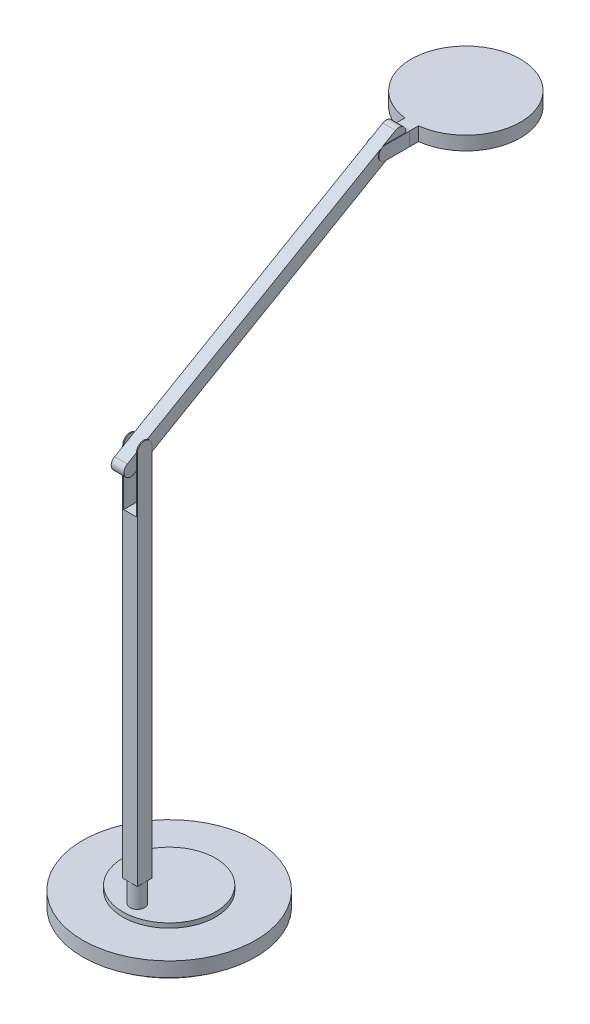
from build123d import *

# Parameters (mm, degrees)
CROQUIS1_R                          = 87
CROQUIS2_R                          = 95
CROQUIS3_R                          = 95
SALIENTE_EXTRUIR1_DEPTH             = 16
CROQUIS4_R                          = 51
SALIENTE_EXTRUIR2_DEPTH             = 5
CROQUIS5_R                          = 8
CROQUIS5_R_2                        = 6
SALIENTE_EXTRUIR3_DEPTH             = 24
SALIENTE_EXTRUIR4_DEPTH             = 420
CROQUIS7_W                          = 14
CROQUIS7_H                          = 16
CORTAR_EXTRUIR1_DEPTH               = 69
CORTAR_EXTRUIR2_DEPTH               = 492.40105824
SALIENTE_EXTRUIR5_REACH             = 491.787
SALIENTE_EXTRUIR5_DIRECTION_2_REACH = 491.787
SALIENTE_EXTRUIR6_DEPTH             = 7.5
SALIENTE_EXTRUIR6_DEPTH_BACK        = 7.5
SALIENTE_EXTRUIR7_DEPTH             = 15
CROQUIS14_R                         = 48
CORTAR_EXTRUIR3_DEPTH               = 2


with BuildPart() as part:
    # Croquis1 → Recubrir1 section 0
    with BuildSketch(Plane(origin=(0, 0, 0), x_dir=(1, 0, 0), z_dir=(0, 1, 0))):
        Circle(CROQUIS1_R)
    # Croquis2 → Recubrir1 section 1
    with BuildSketch(Plane(origin=(0, 6, 0), x_dir=(1, 0, 0), z_dir=(0, 1, 0))):
        Circle(CROQUIS2_R)
    loft()

    # Croquis3 → Saliente-Extruir1 (add)
    with BuildSketch(Plane(origin=(0, 6, 0), x_dir=(1, 0, 0), z_dir=(0, 1, 0))):
        with Locations(Location((0, 0, 0), (0, 0, 270))):
            Circle(CROQUIS3_R)
    extrude(amount=SALIENTE_EXTRUIR1_DEPTH)

    # Croquis4 → Saliente-Extruir2 (add)
    with BuildSketch(Plane(origin=(0, 22, 0), x_dir=(1, 0, 0), z_dir=(0, 1, 0))):
        with Locations(Location((0, 0, 0), (0, 0, 270))):
            Circle(CROQUIS4_R)
    extrude(amount=SALIENTE_EXTRUIR2_DEPTH)

    # Croquis5 → Saliente-Extruir3 (add)
    with BuildSketch(Plane(origin=(0, 27, 0), x_dir=(1, 0, 0), z_dir=(0, 1, 0))):
        with Locations(Location((0, -35, 0), (0, 0, 270))):
            Circle(CROQUIS5_R)
        with Locations(Location((0, -35, 0), (0, 0, 270))):
            Circle(CROQUIS5_R_2, mode=Mode.SUBTRACT)
    extrude(amount=SALIENTE_EXTRUIR3_DEPTH)

    # Croquis6 → Saliente-Extruir4 (add)
    with BuildSketch(Plane(origin=(0, 51, 0), x_dir=(1, 0, 0), z_dir=(0, 1, 0))):
        Polygon((0, -27), (8, -27), (8, -43), (-8, -43), (-8, -27), align=None)
    extrude(amount=SALIENTE_EXTRUIR4_DEPTH)

    # Croquis7 → Cortar-Extruir1 (cut)
    with BuildSketch(Plane(origin=(0, 471, 0), x_dir=(1, 0, 0), z_dir=(0, 1, 0))):
        with Locations((0, -35)):
            Rectangle(CROQUIS7_W, CROQUIS7_H)
    extrude(amount=-CORTAR_EXTRUIR1_DEPTH, mode=Mode.SUBTRACT)

    # Croquis8 → Cortar-Extruir2 (cut, through all)
    with BuildSketch(Plane.ZY.offset(8)):
        with BuildLine():
            Line((27, 471), (27, 463))
            ThreePointArc((27, 463), (29.343145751, 468.656854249), (35, 471))
            Line((35, 471), (27, 471))
        make_face()
        with BuildLine():
            Line((43, 471), (35, 471))
            ThreePointArc((35, 471), (40.656854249, 468.656854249), (43, 463))
            Line((43, 463), (43, 471))
        make_face()
    extrude(amount=-CORTAR_EXTRUIR2_DEPTH, mode=Mode.SUBTRACT)

    # Saliente-Extruir5: up to this face of the body (flat: up to its plane)
    saliente_extruir5_end = Plane(part.part.faces().sort_by_distance((7, 435.665285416, 35))[0])
    # Croquis10 → Saliente-Extruir5 (add, up to the picked face)
    with BuildSketch(Plane(origin=(0, 0, 0), x_dir=(0, 0, -1), z_dir=(1, 0, 0)), mode=Mode.PRIVATE) as saliente_extruir5_sk1:
        with BuildLine():
            Line((-45.40625525, 444.331691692), (-31.25, 452.504809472))
            Line((-31.25, 452.504809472), (249.042382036, 614.331691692))
            ThreePointArc((249.042382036, 614.331691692), (251.787572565, 624.57688222), (241.542382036, 627.322072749))
            Line((241.542382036, 627.322072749), (-35, 467.660254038))
            Line((-35, 467.660254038), (-38.75, 465.495190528))
            Line((-38.75, 465.495190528), (-52.90625525, 457.322072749))
            ThreePointArc((-52.90625525, 457.322072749), (-55.651445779, 447.07688222), (-45.40625525, 444.331691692))
        make_face()
    saliente_extruir5_tool1 = split(extrude(saliente_extruir5_sk1.sketch, amount=SALIENTE_EXTRUIR5_REACH, mode=Mode.PRIVATE), bisect_by=saliente_extruir5_end, keep=Keep.BOTH, mode=Mode.PRIVATE)
    add(saliente_extruir5_tool1.solids().sort_by(Axis((0, 535.826882, -98.068063), (1, 0, 0)))[0])

    # Saliente-Extruir5 direction 2: up to this face of the body (flat: up to its plane)
    saliente_extruir5_direction_2_end = Plane(part.part.faces().sort_by_distance((-7, 435.665285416, 35))[0])
    # Croquis10 → Saliente-Extruir5 direction 2 (add, up to the picked face)
    with BuildSketch(Plane(origin=(0, 0, 0), x_dir=(0, 0, -1), z_dir=(1, 0, 0)), mode=Mode.PRIVATE) as saliente_extruir5_direction_2_sk1:
        with BuildLine():
            Line((-45.40625525, 444.331691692), (-31.25, 452.504809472))
            Line((-31.25, 452.504809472), (249.042382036, 614.331691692))
            ThreePointArc((249.042382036, 614.331691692), (251.787572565, 624.57688222), (241.542382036, 627.322072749))
            Line((241.542382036, 627.322072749), (-35, 467.660254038))
            Line((-35, 467.660254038), (-38.75, 465.495190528))
            Line((-38.75, 465.495190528), (-52.90625525, 457.322072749))
            ThreePointArc((-52.90625525, 457.322072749), (-55.651445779, 447.07688222), (-45.40625525, 444.331691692))
        make_face()
    saliente_extruir5_direction_2_tool1 = split(extrude(saliente_extruir5_direction_2_sk1.sketch, amount=-SALIENTE_EXTRUIR5_DIRECTION_2_REACH, mode=Mode.PRIVATE), bisect_by=saliente_extruir5_direction_2_end, keep=Keep.BOTH, mode=Mode.PRIVATE)
    add(saliente_extruir5_direction_2_tool1.solids().sort_by(Axis((0, 535.826882, -98.068063), (-1, 0, 0)))[0])

    # Croquis11 → Saliente-Extruir6 (add, two sides: drawn at the far end of the back side and taken through both)
    with BuildSketch(Plane(origin=(0, 0, 0), x_dir=(0, 0, -1), z_dir=(1, 0, 0)).offset(-SALIENTE_EXTRUIR6_DEPTH_BACK)):
        with BuildLine():
            Line((256.63693747, 619.57688222), (256.63693747, 604.57688222))
            Line((256.63693747, 604.57688222), (230.13693747, 604.57688222))
            ThreePointArc((230.13693747, 604.57688222), (222.63693747, 612.07688222), (230.13693747, 619.57688222))
            Line((230.13693747, 619.57688222), (256.63693747, 619.57688222))
        make_face()
    extrude(amount=SALIENTE_EXTRUIR6_DEPTH + SALIENTE_EXTRUIR6_DEPTH_BACK)


with BuildPart() as body_2:
    # Croquis13 → Saliente-Extruir7 (new body)
    with BuildSketch(Plane(origin=(0, 619.57688222, 0), x_dir=(1, 0, 0), z_dir=(0, 1, 0))):
        with BuildLine():
            Line((-7.5, 256.63693747), (7.5, 256.63693747))
            Line((7.5, 256.63693747), (7.5, 266.215640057))
            ThreePointArc((7.5, 266.215640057), (0, 385.745044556), (-7.5, 266.215640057))
            Line((-7.5, 266.215640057), (-7.5, 256.63693747))
        make_face()
    extrude(amount=-SALIENTE_EXTRUIR7_DEPTH)

    # Croquis14 → Cortar-Extruir3 (cut)
    with BuildSketch(Plane.XZ.offset(-604.57688222)):
        with Locations(Location((0, -325.745044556, 0), (0, 0, 270))):
            Circle(CROQUIS14_R)
    extrude(amount=-CORTAR_EXTRUIR3_DEPTH, mode=Mode.SUBTRACT)


solid = Compound([part.part, body_2.part])
